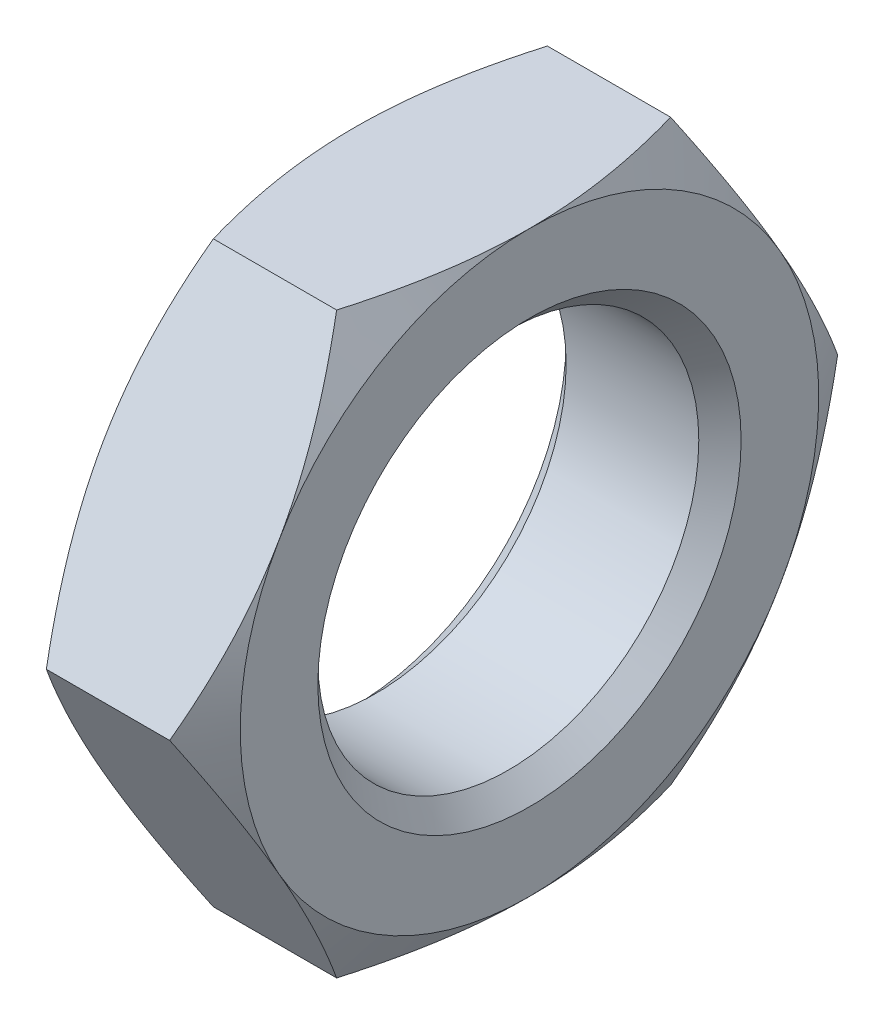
from build123d import *

# Parameters (mm, degrees)
SKETCH1_R      = 13.5
EXTRUDE1_DEPTH = 12.4
CHAMFER1_SIZE  = 1.5


with BuildPart() as part:
    # Sketch1 → Extrude1 (new body)
    with BuildSketch(Plane(origin=(0, 0, 0), x_dir=(0, 0, -1), z_dir=(1, 0, 0))):
        Polygon((11.835680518, 20.5), (-11.835680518, 20.5), (-23.671361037, 0), (-11.835680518, -20.5), (11.835680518, -20.5), (23.671361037, 0), align=None)
        with Locations(Location((0, 0, 0), (0, 0, 180))):
            Circle(SKETCH1_R, mode=Mode.SUBTRACT)
    extrude(amount=EXTRUDE1_DEPTH)

    # Sketch2 → Cut-Revolve1 (revolve, cut)
    with BuildSketch(Plane.XY):
        Polygon((12.4, 20.5), (12.4, 82), (0, 82), (0, 20.5), (6.2, 31.238715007), align=None)
    revolve(axis=Axis((12.4, 0, 0), (-1, 0, 0)), mode=Mode.SUBTRACT)

    # Chamfer1
    chamfer1_edges = [part.edges().sort_by_distance(p)[0] for p in [
        (0, 0, -13.5),
        (12.4, 0, -13.5),
    ]]
    chamfer(chamfer1_edges, length=CHAMFER1_SIZE)


solid = part.part
